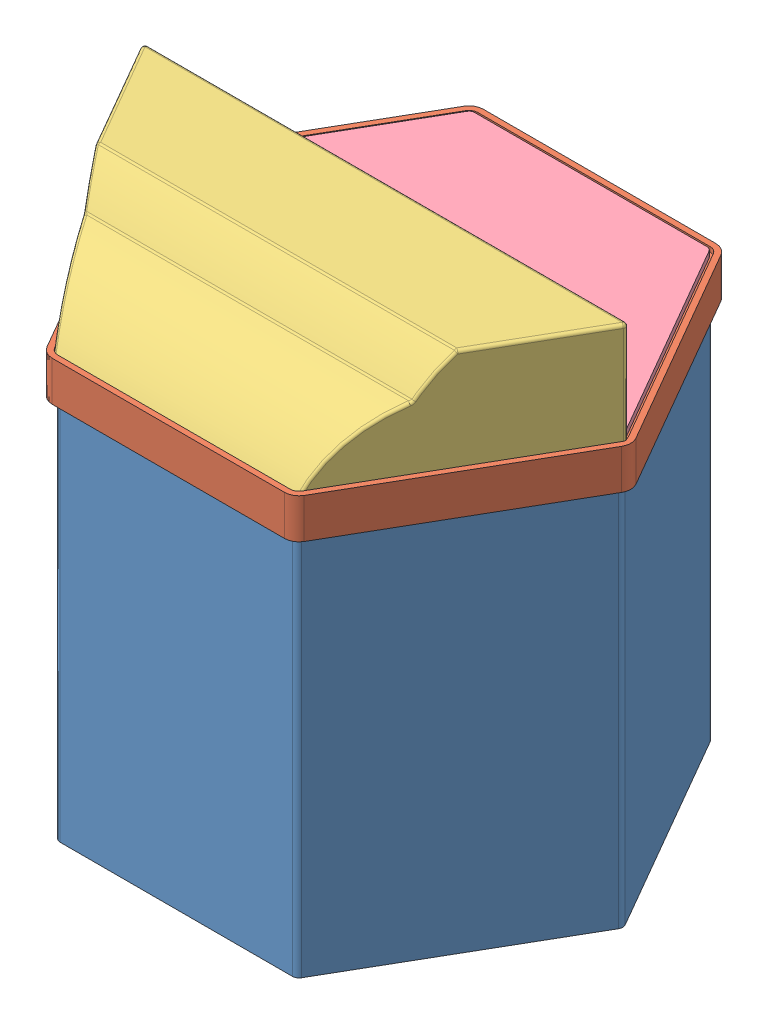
SolidWorks assembly Aquarium.SLDASM, configuration Default (file format 3400). Lengths in mm.
Overall size (392.41 416.8 342.9).
4 component instances, 4 part files, 4 mates.
Components (placement in the parent):
- Tank-1: Tank.SLDPRT [Default] at (0.6277 -167.9134 1.5802) size (379.71 330.2 330.2)
- Hood-1: Hood.SLDPRT [Default] at (0.6277 162.2866 1.5802) x (-1 0 0) z (0 1 0) size (392.41 342.9 31.75)
- CoverFront-1: CoverFront.SLDPRT [Default] at origin size (384.48 84.06 167.63)
- CoverBack-2: CoverBack.SLDPRT [Default] at (0 164.8266 0) x (-1 0 0) z (0 1 0) size (377.25 162.24 5.08)
Mates (geometry in assembly coordinates):
- InPlace1: in place: plane of Tank-1 through (-91.7599 162.2866 -158.4398) normal (0 1 0); unknown of Hood-1
- Coincident1: coincident aligned: plane of ?; plane of ?
- Coincident2: coincident aligned: moOrthogonalPlaneRef_w of ?; plane of ?
- Coincident3: coincident anti-aligned: moOrthogonalPlaneRef_w of ?; plane of ?
